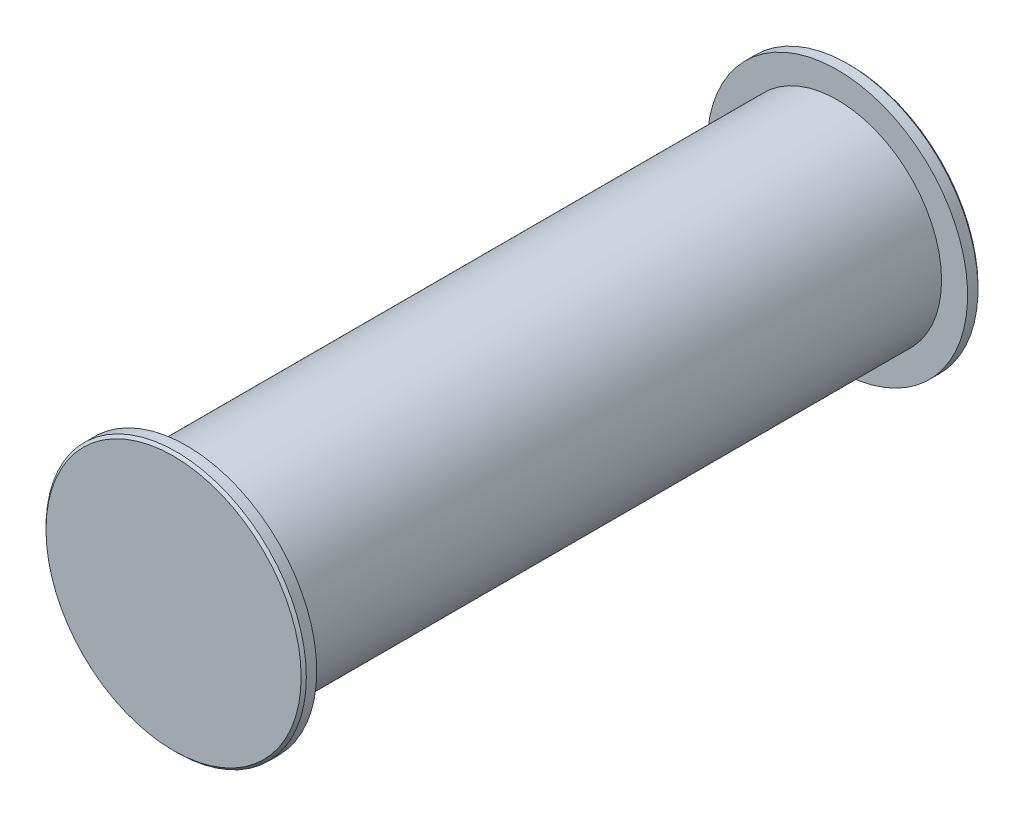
from build123d import *

# Parameters (mm, degrees)
ESQUISSE1_R          = 4
BASE_EXTRUSION_DEPTH = 25
ESQUISSE2_R          = 5
BOSS_EXTRU_1_DEPTH   = 0.5
CHANFREIN1_SIZE      = 0.1
BOSS_EXTRU_2_START   = 0.5
ESQUISSE3_R          = 5
BOSS_EXTRU_2_DEPTH   = 0.5
CHANFREIN2_SIZE      = 0.1


with BuildPart() as part:
    # Esquisse1 → Base-Extrusion (new body)
    with BuildSketch(Plane.XY):
        with Locations(Location((0, 0, 0), (0, 0, 180))):
            Circle(ESQUISSE1_R)
    extrude(amount=BASE_EXTRUSION_DEPTH)

    # Esquisse2 → Boss.-Extru.1 (add)
    with BuildSketch(Plane.XY.offset(25)):
        Circle(ESQUISSE2_R)
    extrude(amount=BOSS_EXTRU_1_DEPTH)

    # Chanfrein1
    chanfrein1_edges = [part.edges().sort_by_distance(p)[0] for p in [
        (-5, 0, 25.5),
    ]]
    chamfer(chanfrein1_edges, length=CHANFREIN1_SIZE)

    # Esquisse3 → Boss.-Extru.2 (add)
    with BuildSketch(Plane(origin=(0, 0, 0), x_dir=(-1, 0, 0), z_dir=(0, 0, -1)).offset(BOSS_EXTRU_2_START)):
        with Locations(Location((0, 0, 0), (0, 0, 180))):
            Circle(ESQUISSE3_R)
    extrude(amount=-BOSS_EXTRU_2_DEPTH)

    # Chanfrein2
    chanfrein2_edges = [part.edges().sort_by_distance(p)[0] for p in [
        (-5, 0, -0.5),
    ]]
    chamfer(chanfrein2_edges, length=CHANFREIN2_SIZE)


solid = part.part
